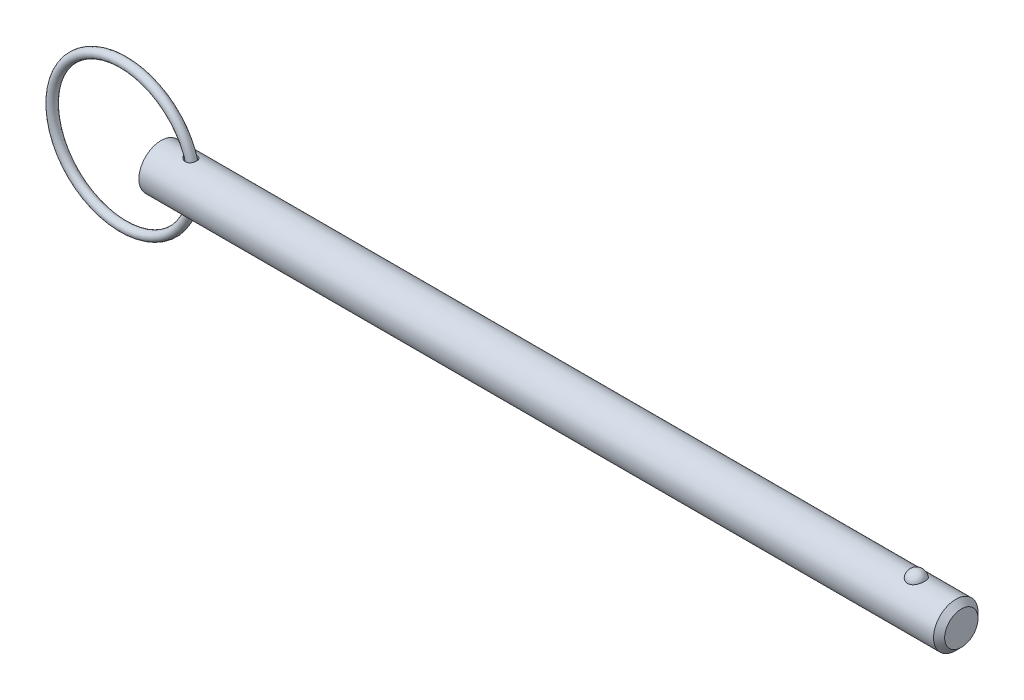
ISO-10303-21;
HEADER;
FILE_DESCRIPTION(('STEP AP214'),'2;1');
FILE_NAME('part.step','',(''),(''),'','','');
FILE_SCHEMA(('AUTOMOTIVE_DESIGN { 1 0 10303 214 1 1 1 1 }'));
ENDSEC;
DATA;
#1=APPLICATION_CONTEXT('core data for automotive mechanical design processes');
#2=APPLICATION_PROTOCOL_DEFINITION('international standard','automotive_design',2000,#1);
#3=PRODUCT_CONTEXT('',#1,'mechanical');
#4=PRODUCT('Part','Part','',(#3));
#5=PRODUCT_RELATED_PRODUCT_CATEGORY('part','',(#4));
#6=PRODUCT_DEFINITION_FORMATION('','',#4);
#7=PRODUCT_DEFINITION_CONTEXT('part definition',#1,'design');
#8=PRODUCT_DEFINITION('design','',#6,#7);
#9=PRODUCT_DEFINITION_SHAPE('','',#8);
#10=(LENGTH_UNIT() NAMED_UNIT(*) SI_UNIT(.MILLI.,.METRE.));
#11=(NAMED_UNIT(*) PLANE_ANGLE_UNIT() SI_UNIT($,.RADIAN.));
#12=(NAMED_UNIT(*) SI_UNIT($,.STERADIAN.) SOLID_ANGLE_UNIT());
#13=UNCERTAINTY_MEASURE_WITH_UNIT(LENGTH_MEASURE(1.E-05),#10,'distance_accuracy_value','');
#14=(GEOMETRIC_REPRESENTATION_CONTEXT(3) GLOBAL_UNCERTAINTY_ASSIGNED_CONTEXT((#13)) GLOBAL_UNIT_ASSIGNED_CONTEXT((#10,
#11,#12)) REPRESENTATION_CONTEXT('',''));
#15=CARTESIAN_POINT('',(0.,0.,0.));
#16=DIRECTION('',(0.,0.,1.));
#17=DIRECTION('',(1.,0.,0.));
#18=AXIS2_PLACEMENT_3D('',#15,#16,#17);
#19=CARTESIAN_POINT('',(-6.75433730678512,0.,0.));
#20=DIRECTION('',(0.,0.,1.));
#21=DIRECTION('',(1.,0.,0.));
#22=AXIS2_PLACEMENT_3D('',#19,#20,#21);
#23=TOROIDAL_SURFACE('',#22,12.7,0.794);
#24=CARTESIAN_POINT('',(6.73966269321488,0.,0.));
#25=VERTEX_POINT('',#24);
#26=VERTEX_LOOP('',#25);
#27=FACE_BOUND('',#26,.T.);
#28=ADVANCED_FACE('P0_F12',(#27),#23,.T.);
#29=CLOSED_SHELL('',(#28));
#30=MANIFOLD_SOLID_BREP('P0_B1',#29);
#31=CARTESIAN_POINT('',(0.,0.,0.));
#32=DIRECTION('',(1.,0.,0.));
#33=DIRECTION('',(0.,0.,-1.));
#34=AXIS2_PLACEMENT_3D('',#31,#32,#33);
#35=CYLINDRICAL_SURFACE('',#34,3.97);
#36=CARTESIAN_POINT('',(4.50613409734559,3.92152479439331,-0.618499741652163));
#37=CARTESIAN_POINT('',(4.54853517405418,3.91408351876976,-0.665679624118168));
#38=CARTESIAN_POINT('',(4.59520918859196,3.90637054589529,-0.709047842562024));
#39=CARTESIAN_POINT('',(4.69529850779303,3.89134328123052,-0.787367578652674));
#40=CARTESIAN_POINT('',(4.74872860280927,3.88402991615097,-0.822300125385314));
#41=CARTESIAN_POINT('',(4.86059505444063,3.87069188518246,-0.882953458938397));
#42=CARTESIAN_POINT('',(4.91902090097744,3.86466460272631,-0.908693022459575));
#43=CARTESIAN_POINT('',(5.03942053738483,3.85463812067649,-0.950329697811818));
#44=CARTESIAN_POINT('',(5.10139227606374,3.85063776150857,-0.966232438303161));
#45=CARTESIAN_POINT('',(5.22799334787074,3.84521819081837,-0.987584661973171));
#46=CARTESIAN_POINT('',(5.29264515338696,3.84382942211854,-0.992910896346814));
#47=CARTESIAN_POINT('',(5.4218778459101,3.84405510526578,-0.992040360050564));
#48=CARTESIAN_POINT('',(5.48645875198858,3.84566813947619,-0.985849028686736));
#49=CARTESIAN_POINT('',(5.60832575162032,3.85155853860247,-0.962561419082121));
#50=CARTESIAN_POINT('',(5.66579014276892,3.85562063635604,-0.946343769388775));
#51=CARTESIAN_POINT('',(5.77675338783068,3.86576598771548,-0.904004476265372));
#52=CARTESIAN_POINT('',(5.83025379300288,3.87184844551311,-0.877886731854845));
#53=CARTESIAN_POINT('',(5.92811265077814,3.88482601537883,-0.818464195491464));
#54=CARTESIAN_POINT('',(5.97284196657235,3.89164057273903,-0.785750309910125));
#55=CARTESIAN_POINT('',(6.05599619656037,3.90559314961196,-0.713164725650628));
#56=CARTESIAN_POINT('',(6.09442162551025,3.91273114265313,-0.673293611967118));
#57=CARTESIAN_POINT('',(6.16349552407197,3.92643411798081,-0.588089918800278));
#58=CARTESIAN_POINT('',(6.19423746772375,3.93300527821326,-0.542833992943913));
#59=CARTESIAN_POINT('',(6.24784048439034,3.94496273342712,-0.447731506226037));
#60=CARTESIAN_POINT('',(6.27070130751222,3.95034899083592,-0.3978847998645));
#61=CARTESIAN_POINT('',(6.30819009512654,3.95940331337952,-0.294515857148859));
#62=CARTESIAN_POINT('',(6.32274046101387,3.96305513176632,-0.240964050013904));
#63=CARTESIAN_POINT('',(6.34295490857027,3.96817541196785,-0.132107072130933));
#64=CARTESIAN_POINT('',(6.3486187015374,3.96964380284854,-0.0768018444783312));
#65=CARTESIAN_POINT('',(6.35094049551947,3.97024250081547,0.0343098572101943));
#66=CARTESIAN_POINT('',(6.34754972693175,3.96936014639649,0.0901174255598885));
#67=CARTESIAN_POINT('',(6.33173352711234,3.9653248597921,0.200354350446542));
#68=CARTESIAN_POINT('',(6.31930791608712,3.96217188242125,0.254783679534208));
#69=CARTESIAN_POINT('',(6.28569545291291,3.95393415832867,0.360736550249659));
#70=CARTESIAN_POINT('',(6.26450524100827,3.94884867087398,0.412258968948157));
#71=CARTESIAN_POINT('',(6.21385621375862,3.93730247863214,0.510898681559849));
#72=CARTESIAN_POINT('',(6.18439757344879,3.93084180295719,0.558016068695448));
#73=CARTESIAN_POINT('',(6.11807283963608,3.91729312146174,0.646300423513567));
#74=CARTESIAN_POINT('',(6.08123803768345,3.91020783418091,0.687491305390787));
#75=CARTESIAN_POINT('',(6.00105036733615,3.89618447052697,0.762970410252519));
#76=CARTESIAN_POINT('',(5.95769831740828,3.88924637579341,0.79725949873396));
#77=CARTESIAN_POINT('',(5.8661353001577,3.87636375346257,0.857702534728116));
#78=CARTESIAN_POINT('',(5.81797537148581,3.87041026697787,0.883931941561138));
#79=CARTESIAN_POINT('',(5.71784316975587,3.86006042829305,0.928089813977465));
#80=CARTESIAN_POINT('',(5.66587104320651,3.85566401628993,0.946018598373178));
#81=CARTESIAN_POINT('',(5.55935910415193,3.84884784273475,0.973381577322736));
#82=CARTESIAN_POINT('',(5.50480823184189,3.84643760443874,0.982774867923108));
#83=CARTESIAN_POINT('',(5.39486598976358,3.84381055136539,0.992999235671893));
#84=CARTESIAN_POINT('',(5.33947443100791,3.84359423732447,0.993828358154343));
#85=CARTESIAN_POINT('',(5.2264823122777,3.84533176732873,0.987084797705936));
#86=CARTESIAN_POINT('',(5.16890896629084,3.84739412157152,0.979092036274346));
#87=CARTESIAN_POINT('',(5.05572652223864,3.85355237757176,0.954563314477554));
#88=CARTESIAN_POINT('',(5.00011821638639,3.85764908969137,0.938023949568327));
#89=CARTESIAN_POINT('',(4.88760177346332,3.86780726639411,0.895259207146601));
#90=CARTESIAN_POINT('',(4.83096658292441,3.87400321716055,0.868345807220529));
#91=CARTESIAN_POINT('',(4.72283286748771,3.88749324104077,0.805802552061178));
#92=CARTESIAN_POINT('',(4.6713374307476,3.89478796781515,0.770167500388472));
#93=CARTESIAN_POINT('',(4.57320957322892,3.90992457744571,0.689306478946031));
#94=CARTESIAN_POINT('',(4.52683185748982,3.91777672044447,0.643771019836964));
#95=CARTESIAN_POINT('',(4.44324307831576,3.93275681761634,0.544809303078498));
#96=CARTESIAN_POINT('',(4.40602610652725,3.939885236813,0.491388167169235));
#97=CARTESIAN_POINT('',(4.34571986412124,3.95183347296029,0.382912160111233));
#98=CARTESIAN_POINT('',(4.32168268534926,3.95680025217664,0.328404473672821));
#99=CARTESIAN_POINT('',(4.28478280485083,3.96454157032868,0.215602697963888));
#100=CARTESIAN_POINT('',(4.27190231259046,3.96731959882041,0.157314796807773));
#101=CARTESIAN_POINT('',(4.25937356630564,3.97002560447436,0.0481762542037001));
#102=CARTESIAN_POINT('',(4.25802727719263,3.97031923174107,-0.00247526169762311));
#103=CARTESIAN_POINT('',(4.26422295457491,3.96897737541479,-0.103210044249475));
#104=CARTESIAN_POINT('',(4.27176468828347,3.96734194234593,-0.153293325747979));
#105=CARTESIAN_POINT('',(4.29457390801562,3.96248430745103,-0.248530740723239));
#106=CARTESIAN_POINT('',(4.30937736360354,3.95935769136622,-0.293803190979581));
#107=CARTESIAN_POINT('',(4.34569993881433,3.95187968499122,-0.381417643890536));
#108=CARTESIAN_POINT('',(4.36721517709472,3.94752900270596,-0.42376132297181));
#109=CARTESIAN_POINT('',(4.40821696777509,3.93952317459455,-0.491758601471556));
#110=CARTESIAN_POINT('',(4.42613511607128,3.93609353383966,-0.518404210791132));
#111=CARTESIAN_POINT('',(4.46438343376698,3.92897396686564,-0.569857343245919));
#112=CARTESIAN_POINT('',(4.48471350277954,3.92528405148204,-0.594664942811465));
#113=CARTESIAN_POINT('',(4.50613409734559,3.92152479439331,-0.618499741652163));
#114=B_SPLINE_CURVE_WITH_KNOTS('',3,(#36,#37,#38,#39,#40,#41,#42,#43,#44,#45,#46,#47,#48,#49,
#50,#51,#52,#53,#54,#55,#56,#57,#58,#59,#60,#61,#62,#63,#64,#65,#66,#67,#68,#69,#70,#71,#72,#73,
#74,#75,#76,#77,#78,#79,#80,#81,#82,#83,#84,#85,#86,#87,#88,#89,#90,#91,#92,#93,#94,#95,#96,#97,
#98,#99,#100,#101,#102,#103,#104,#105,#106,#107,#108,#109,#110,#111,#112,#113),.UNSPECIFIED.,
.T.,.F.,(4,2,2,2,2,2,2,2,2,2,2,2,2,2,2,2,2,2,2,2,2,2,2,2,2,2,2,2,2,2,2,2,2,2,2,2,2,2,4),(0.,
0.191481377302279,0.383389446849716,0.574903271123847,0.766307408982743,0.959929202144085,
1.15345957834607,1.33205157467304,1.51057330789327,1.67726576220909,1.84394459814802,
2.00848443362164,2.17302948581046,2.33908685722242,2.50514962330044,2.6721086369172,
2.83907097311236,3.00609737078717,3.17312023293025,3.33944900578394,3.5057569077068,
3.67045663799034,3.83515004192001,4.00062859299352,4.16614491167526,4.33989638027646,
4.51371711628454,4.70191549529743,4.8902262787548,5.08559712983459,5.28084164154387,
5.45908728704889,5.63704817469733,5.78825771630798,5.93946329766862,6.08206496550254,
6.22458432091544,6.32132279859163,6.41805725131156),.UNSPECIFIED.);
#115=CARTESIAN_POINT('',(4.50613409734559,3.92152479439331,-0.618499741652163));
#116=VERTEX_POINT('',#115);
#117=EDGE_CURVE('P1_E40',#116,#116,#114,.T.);
#118=ORIENTED_EDGE('',*,*,#117,.T.);
#119=EDGE_LOOP('',(#118));
#120=FACE_BOUND('',#119,.T.);
#121=CARTESIAN_POINT('',(141.8875,0.,0.));
#122=DIRECTION('',(1.,0.,0.));
#123=DIRECTION('',(0.,0.,-1.));
#124=AXIS2_PLACEMENT_3D('',#121,#122,#123);
#125=CIRCLE('',#124,3.97);
#126=CARTESIAN_POINT('',(141.8875,0.,-3.97));
#127=VERTEX_POINT('',#126);
#128=EDGE_CURVE('P1_E25',#127,#127,#125,.T.);
#129=ORIENTED_EDGE('',*,*,#128,.F.);
#130=EDGE_LOOP('',(#129));
#131=FACE_BOUND('',#130,.T.);
#132=CARTESIAN_POINT('',(0.,0.,0.));
#133=DIRECTION('',(1.,0.,0.));
#134=DIRECTION('',(0.,0.,-1.));
#135=AXIS2_PLACEMENT_3D('',#132,#133,#134);
#136=CIRCLE('',#135,3.97);
#137=CARTESIAN_POINT('',(0.,0.,-3.97));
#138=VERTEX_POINT('',#137);
#139=EDGE_CURVE('P1_E9',#138,#138,#136,.T.);
#140=ORIENTED_EDGE('',*,*,#139,.T.);
#141=EDGE_LOOP('',(#140));
#142=FACE_BOUND('',#141,.T.);
#143=CARTESIAN_POINT('',(134.845192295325,3.65715365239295,1.54470941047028));
#144=CARTESIAN_POINT('',(134.765244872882,3.65716001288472,1.54470290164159));
#145=CARTESIAN_POINT('',(134.685165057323,3.65987074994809,1.53832549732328));
#146=CARTESIAN_POINT('',(134.527237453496,3.67042218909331,1.51297018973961));
#147=CARTESIAN_POINT('',(134.44939614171,3.67827646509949,1.49395894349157));
#148=CARTESIAN_POINT('',(134.298461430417,3.69818848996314,1.44395950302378));
#149=CARTESIAN_POINT('',(134.225356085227,3.71023513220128,1.41300293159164));
#150=CARTESIAN_POINT('',(134.085563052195,3.73721833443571,1.34000212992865));
#151=CARTESIAN_POINT('',(134.018872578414,3.75215363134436,1.2979627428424));
#152=CARTESIAN_POINT('',(133.89148864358,3.78384968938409,1.20248834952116));
#153=CARTESIAN_POINT('',(133.831029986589,3.80065129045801,1.14875388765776));
#154=CARTESIAN_POINT('',(133.719694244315,3.83398532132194,1.03205417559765));
#155=CARTESIAN_POINT('',(133.668820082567,3.85051766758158,0.969086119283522));
#156=CARTESIAN_POINT('',(133.575632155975,3.88238608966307,0.832526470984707));
#157=CARTESIAN_POINT('',(133.533796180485,3.89763698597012,0.758588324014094));
#158=CARTESIAN_POINT('',(133.46251087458,3.92451063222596,0.604352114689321));
#159=CARTESIAN_POINT('',(133.433062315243,3.93613315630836,0.524053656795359));
#160=CARTESIAN_POINT('',(133.386892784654,3.95467606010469,0.358403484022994));
#161=CARTESIAN_POINT('',(133.370312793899,3.96154426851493,0.273006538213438));
#162=CARTESIAN_POINT('',(133.350756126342,3.96967008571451,0.100408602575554));
#163=CARTESIAN_POINT('',(133.347778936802,3.97092790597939,0.0132076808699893));
#164=CARTESIAN_POINT('',(133.355458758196,3.96771794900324,-0.15984454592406));
#165=CARTESIAN_POINT('',(133.366016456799,3.96329187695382,-0.24570105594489));
#166=CARTESIAN_POINT('',(133.40038009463,3.94923163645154,-0.414277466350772));
#167=CARTESIAN_POINT('',(133.424186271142,3.93959737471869,-0.496997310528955));
#168=CARTESIAN_POINT('',(133.48461142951,3.91607752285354,-0.657113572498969));
#169=CARTESIAN_POINT('',(133.521249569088,3.90218558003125,-0.734501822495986));
#170=CARTESIAN_POINT('',(133.606593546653,3.87158287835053,-0.881704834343));
#171=CARTESIAN_POINT('',(133.655300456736,3.85487186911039,-0.951518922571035));
#172=CARTESIAN_POINT('',(133.764116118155,3.82028735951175,-1.08208159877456));
#173=CARTESIAN_POINT('',(133.824295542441,3.80240713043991,-1.14276958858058));
#174=CARTESIAN_POINT('',(133.954493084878,3.76758161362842,-1.25282437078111));
#175=CARTESIAN_POINT('',(134.024510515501,3.75063626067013,-1.30219195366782));
#176=CARTESIAN_POINT('',(134.17118160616,3.71998948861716,-1.38729709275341));
#177=CARTESIAN_POINT('',(134.247681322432,3.70623183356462,-1.42327904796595));
#178=CARTESIAN_POINT('',(134.406298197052,3.68323188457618,-1.48178996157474));
#179=CARTESIAN_POINT('',(134.4884132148,3.67398788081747,-1.50432401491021));
#180=CARTESIAN_POINT('',(134.651481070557,3.6615216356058,-1.53440939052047));
#181=CARTESIAN_POINT('',(134.732284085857,3.65801951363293,-1.54265826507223));
#182=CARTESIAN_POINT('',(134.89420850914,3.65657341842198,-1.54608423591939));
#183=CARTESIAN_POINT('',(134.975329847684,3.65862829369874,-1.54126404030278));
#184=CARTESIAN_POINT('',(135.132812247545,3.66788969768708,-1.51908474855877));
#185=CARTESIAN_POINT('',(135.209242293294,3.67492621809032,-1.50213925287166));
#186=CARTESIAN_POINT('',(135.358041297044,3.6931840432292,-1.45666982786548));
#187=CARTESIAN_POINT('',(135.430409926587,3.70440568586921,-1.42814496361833));
#188=CARTESIAN_POINT('',(135.570802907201,3.73012749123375,-1.3595631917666));
#189=CARTESIAN_POINT('',(135.638700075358,3.74469307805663,-1.31927107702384));
#190=CARTESIAN_POINT('',(135.766864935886,3.77545272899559,-1.2284744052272));
#191=CARTESIAN_POINT('',(135.827130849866,3.79164717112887,-1.17796747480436));
#192=CARTESIAN_POINT('',(135.941634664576,3.82490325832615,-1.06519260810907));
#193=CARTESIAN_POINT('',(135.995413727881,3.84196735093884,-1.00245914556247));
#194=CARTESIAN_POINT('',(136.092098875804,3.8743986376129,-0.868715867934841));
#195=CARTESIAN_POINT('',(136.135003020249,3.88976552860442,-0.79770457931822));
#196=CARTESIAN_POINT('',(136.210266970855,3.91771381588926,-0.646896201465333));
#197=CARTESIAN_POINT('',(136.24225322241,3.93019255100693,-0.56689319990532));
#198=CARTESIAN_POINT('',(136.293110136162,3.95043886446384,-0.402255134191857));
#199=CARTESIAN_POINT('',(136.311980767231,3.95820643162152,-0.317620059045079));
#200=CARTESIAN_POINT('',(136.33621625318,3.96823733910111,-0.146156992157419));
#201=CARTESIAN_POINT('',(136.341587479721,3.970503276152,-0.059330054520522));
#202=CARTESIAN_POINT('',(136.338730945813,3.96930811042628,0.114057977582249));
#203=CARTESIAN_POINT('',(136.330503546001,3.9658471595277,0.200619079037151));
#204=CARTESIAN_POINT('',(136.300706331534,3.95358562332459,0.370506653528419));
#205=CARTESIAN_POINT('',(136.27921294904,3.94481563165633,0.453848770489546));
#206=CARTESIAN_POINT('',(136.22338397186,3.92284586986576,0.615497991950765));
#207=CARTESIAN_POINT('',(136.189047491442,3.90964579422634,0.693804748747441));
#208=CARTESIAN_POINT('',(136.107970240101,3.88006987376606,0.843703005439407));
#209=CARTESIAN_POINT('',(136.061153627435,3.86367478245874,0.915249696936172));
#210=CARTESIAN_POINT('',(135.956189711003,3.82949741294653,1.04910810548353));
#211=CARTESIAN_POINT('',(135.898042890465,3.81171519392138,1.11142021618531));
#212=CARTESIAN_POINT('',(135.771743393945,3.7767336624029,1.22503948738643));
#213=CARTESIAN_POINT('',(135.703597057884,3.75953398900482,1.27635357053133));
#214=CARTESIAN_POINT('',(135.558900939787,3.72770506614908,1.36653336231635));
#215=CARTESIAN_POINT('',(135.482348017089,3.7130767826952,1.4053943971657));
#216=CARTESIAN_POINT('',(135.325759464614,3.68864287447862,1.46830480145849));
#217=CARTESIAN_POINT('',(135.245930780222,3.67869017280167,1.49281289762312));
#218=CARTESIAN_POINT('',(135.082987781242,3.66414535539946,1.52817474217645));
#219=CARTESIAN_POINT('',(134.999884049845,3.65953723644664,1.53906926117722));
#220=CARTESIAN_POINT('',(134.892776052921,3.6573894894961,1.54414878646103));
#221=CARTESIAN_POINT('',(134.868990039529,3.65715175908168,1.54471134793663));
#222=CARTESIAN_POINT('',(134.845192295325,3.65715365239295,1.54470941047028));
#223=B_SPLINE_CURVE_WITH_KNOTS('',3,(#143,#144,#145,#146,#147,#148,#149,#150,#151,#152,#153,
#154,#155,#156,#157,#158,#159,#160,#161,#162,#163,#164,#165,#166,#167,#168,#169,#170,#171,#172,
#173,#174,#175,#176,#177,#178,#179,#180,#181,#182,#183,#184,#185,#186,#187,#188,#189,#190,#191,
#192,#193,#194,#195,#196,#197,#198,#199,#200,#201,#202,#203,#204,#205,#206,#207,#208,#209,#210,
#211,#212,#213,#214,#215,#216,#217,#218,#219,#220,#221,#222),.UNSPECIFIED.,.T.,.F.,(4,2,2,2,2,2,
2,2,2,2,2,2,2,2,2,2,2,2,2,2,2,2,2,2,2,2,2,2,2,2,2,2,2,2,2,2,2,2,2,4),(0.,0.239777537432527,
0.48019041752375,0.719971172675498,0.959647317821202,1.20639040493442,1.45320863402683,
1.71093679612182,1.96868099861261,2.22921052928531,2.48973023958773,2.74834928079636,
3.00697295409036,3.26598440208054,3.52501886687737,3.78570385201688,4.04637062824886,
4.30201257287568,4.55755760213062,4.80022994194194,5.04285200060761,5.27757006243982,
5.5123070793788,5.75210128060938,5.99195126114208,6.24392810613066,6.49594987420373,
6.75588818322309,7.01582710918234,7.27564332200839,7.53545264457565,7.79377886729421,
8.05212290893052,8.31207418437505,8.57201437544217,8.83179046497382,9.09166393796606,
9.3427005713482,9.59298357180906,9.66435753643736),.UNSPECIFIED.);
#224=CARTESIAN_POINT('',(134.845192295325,3.65715365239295,1.54470941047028));
#225=VERTEX_POINT('',#224);
#226=EDGE_CURVE('P1_E34',#225,#225,#223,.T.);
#227=ORIENTED_EDGE('',*,*,#226,.T.);
#228=EDGE_LOOP('',(#227));
#229=FACE_BOUND('',#228,.T.);
#230=CARTESIAN_POINT('',(4.50613409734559,-3.92152479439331,-0.618499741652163));
#231=CARTESIAN_POINT('',(4.47063221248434,-3.92775524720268,-0.57899519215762));
#232=CARTESIAN_POINT('',(4.43810149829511,-3.93379908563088,-0.536794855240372));
#233=CARTESIAN_POINT('',(4.38017497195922,-3.94493883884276,-0.447628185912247));
#234=CARTESIAN_POINT('',(4.3547746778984,-3.95003534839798,-0.400664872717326));
#235=CARTESIAN_POINT('',(4.3122178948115,-3.95875465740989,-0.302642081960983));
#236=CARTESIAN_POINT('',(4.29511088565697,-3.96236859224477,-0.251560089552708));
#237=CARTESIAN_POINT('',(4.27046538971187,-3.96762012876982,-0.14703606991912));
#238=CARTESIAN_POINT('',(4.26292104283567,-3.96925894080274,-0.0935955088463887));
#239=CARTESIAN_POINT('',(4.25814817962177,-3.97029345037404,0.00916757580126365));
#240=CARTESIAN_POINT('',(4.26009234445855,-3.96986905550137,0.058451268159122));
#241=CARTESIAN_POINT('',(4.27229463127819,-3.96723648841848,0.15592126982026));
#242=CARTESIAN_POINT('',(4.28255257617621,-3.96502835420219,0.204107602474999));
#243=CARTESIAN_POINT('',(4.31040382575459,-3.95915538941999,0.296804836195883));
#244=CARTESIAN_POINT('',(4.32779766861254,-3.95553028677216,0.341378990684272));
#245=CARTESIAN_POINT('',(4.36906896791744,-3.94717481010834,0.427290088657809));
#246=CARTESIAN_POINT('',(4.39294824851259,-3.94244412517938,0.468626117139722));
#247=CARTESIAN_POINT('',(4.44891306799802,-3.93178155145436,0.551268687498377));
#248=CARTESIAN_POINT('',(4.48157347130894,-3.92577737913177,0.592175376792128));
#249=CARTESIAN_POINT('',(4.5525111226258,-3.91346489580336,0.668729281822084));
#250=CARTESIAN_POINT('',(4.59079150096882,-3.90715641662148,0.704373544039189));
#251=CARTESIAN_POINT('',(4.67775521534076,-3.89387548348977,0.774654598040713));
#252=CARTESIAN_POINT('',(4.72714377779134,-3.88693620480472,0.808427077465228));
#253=CARTESIAN_POINT('',(4.83064277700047,-3.8740635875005,0.868022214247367));
#254=CARTESIAN_POINT('',(4.88475591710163,-3.86813083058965,0.893840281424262));
#255=CARTESIAN_POINT('',(5.00110106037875,-3.85749476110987,0.93872983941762));
#256=CARTESIAN_POINT('',(5.06363405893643,-3.85293457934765,0.957062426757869));
#257=CARTESIAN_POINT('',(5.19104406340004,-3.84642688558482,0.98289453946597));
#258=CARTESIAN_POINT('',(5.25592057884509,-3.84447883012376,0.990396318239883));
#259=CARTESIAN_POINT('',(5.38389367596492,-3.84360582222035,0.993779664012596));
#260=CARTESIAN_POINT('',(5.44697893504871,-3.84458391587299,0.990033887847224));
#261=CARTESIAN_POINT('',(5.57135239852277,-3.84935403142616,0.971322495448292));
#262=CARTESIAN_POINT('',(5.63264168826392,-3.85314431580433,0.956363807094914));
#263=CARTESIAN_POINT('',(5.74616757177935,-3.86267246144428,0.917075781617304));
#264=CARTESIAN_POINT('',(5.79873169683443,-3.86821908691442,0.893643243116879));
#265=CARTESIAN_POINT('',(5.89880370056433,-3.88065529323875,0.837987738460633));
#266=CARTESIAN_POINT('',(5.94631268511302,-3.88754457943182,0.805766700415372));
#267=CARTESIAN_POINT('',(6.03285109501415,-3.90151699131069,0.735052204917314));
#268=CARTESIAN_POINT('',(6.07216200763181,-3.90857818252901,0.696897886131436));
#269=CARTESIAN_POINT('',(6.14379115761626,-3.92238187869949,0.614461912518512));
#270=CARTESIAN_POINT('',(6.17610956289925,-3.92912439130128,0.570180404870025));
#271=CARTESIAN_POINT('',(6.23298117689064,-3.94155789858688,0.47670081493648));
#272=CARTESIAN_POINT('',(6.25752764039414,-3.94724797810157,0.427498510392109));
#273=CARTESIAN_POINT('',(6.29825018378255,-3.95695712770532,0.325589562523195));
#274=CARTESIAN_POINT('',(6.31442591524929,-3.96097612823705,0.272882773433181));
#275=CARTESIAN_POINT('',(6.33815165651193,-3.96694319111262,0.164947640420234));
#276=CARTESIAN_POINT('',(6.34562253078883,-3.96887224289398,0.109700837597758));
#277=CARTESIAN_POINT('',(6.35150690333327,-3.97038782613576,-0.00130546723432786));
#278=CARTESIAN_POINT('',(6.34992017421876,-3.96997429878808,-0.0570649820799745));
#279=CARTESIAN_POINT('',(6.33770614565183,-3.96684417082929,-0.167685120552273));
#280=CARTESIAN_POINT('',(6.32705245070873,-3.96412084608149,-0.222542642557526));
#281=CARTESIAN_POINT('',(6.29690849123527,-3.95665587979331,-0.329631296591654));
#282=CARTESIAN_POINT('',(6.27741810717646,-3.95191421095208,-0.381862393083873));
#283=CARTESIAN_POINT('',(6.2300755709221,-3.94093577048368,-0.482151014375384));
#284=CARTESIAN_POINT('',(6.20223216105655,-3.93470056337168,-0.530212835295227));
#285=CARTESIAN_POINT('',(6.13885089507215,-3.92142345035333,-0.620836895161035));
#286=CARTESIAN_POINT('',(6.10331353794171,-3.9143815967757,-0.663399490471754));
#287=CARTESIAN_POINT('',(6.02573506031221,-3.90033441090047,-0.741525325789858));
#288=CARTESIAN_POINT('',(5.98374081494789,-3.89332916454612,-0.777135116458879));
#289=CARTESIAN_POINT('',(5.89422937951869,-3.88009391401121,-0.840731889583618));
#290=CARTESIAN_POINT('',(5.84671289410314,-3.87386381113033,-0.868719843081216));
#291=CARTESIAN_POINT('',(5.74792005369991,-3.86290904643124,-0.916201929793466));
#292=CARTESIAN_POINT('',(5.69667597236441,-3.85817300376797,-0.935760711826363));
#293=CARTESIAN_POINT('',(5.59158164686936,-3.85061943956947,-0.966374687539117));
#294=CARTESIAN_POINT('',(5.53773121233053,-3.84780205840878,-0.97742925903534));
#295=CARTESIAN_POINT('',(5.42780663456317,-3.844282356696,-0.991183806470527));
#296=CARTESIAN_POINT('',(5.37170954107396,-3.84362414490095,-0.993709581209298));
#297=CARTESIAN_POINT('',(5.25980914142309,-3.84452352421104,-0.990222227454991));
#298=CARTESIAN_POINT('',(5.20400591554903,-3.84608169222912,-0.984206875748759));
#299=CARTESIAN_POINT('',(5.09021941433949,-3.85134557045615,-0.963410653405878));
#300=CARTESIAN_POINT('',(5.0323470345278,-3.85519050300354,-0.948059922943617));
#301=CARTESIAN_POINT('',(4.9197292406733,-3.86464451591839,-0.908751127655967));
#302=CARTESIAN_POINT('',(4.86498619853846,-3.87025491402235,-0.884786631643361));
#303=CARTESIAN_POINT('',(4.75497621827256,-3.88320265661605,-0.826208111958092));
#304=CARTESIAN_POINT('',(4.70013922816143,-3.89065244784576,-0.790807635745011));
#305=CARTESIAN_POINT('',(4.59743373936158,-3.90600301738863,-0.711112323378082));
#306=CARTESIAN_POINT('',(4.54956105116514,-3.91390352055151,-0.66682287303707));
#307=CARTESIAN_POINT('',(4.50613409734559,-3.92152479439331,-0.618499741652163));
#308=B_SPLINE_CURVE_WITH_KNOTS('',3,(#230,#231,#232,#233,#234,#235,#236,#237,#238,#239,#240,
#241,#242,#243,#244,#245,#246,#247,#248,#249,#250,#251,#252,#253,#254,#255,#256,#257,#258,#259,
#260,#261,#262,#263,#264,#265,#266,#267,#268,#269,#270,#271,#272,#273,#274,#275,#276,#277,#278,
#279,#280,#281,#282,#283,#284,#285,#286,#287,#288,#289,#290,#291,#292,#293,#294,#295,#296,#297,
#298,#299,#300,#301,#302,#303,#304,#305,#306,#307),.UNSPECIFIED.,.T.,.F.,(4,2,2,2,2,2,2,2,2,2,2,
2,2,2,2,2,2,2,2,2,2,2,2,2,2,2,2,2,2,2,2,2,2,2,2,2,2,2,4),(0.,0.160252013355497,
0.320403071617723,0.481498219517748,0.642494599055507,0.789717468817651,0.936937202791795,
1.08029540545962,1.22369397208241,1.38114509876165,1.53868426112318,1.7186296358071,
1.89867865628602,2.09368931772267,2.28865940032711,2.47724174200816,2.66570766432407,
2.83827720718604,3.01080892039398,3.17573461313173,3.34065634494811,3.50572082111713,
3.67079216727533,3.83735274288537,4.00391749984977,4.17096882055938,4.33802240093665,
4.50490174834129,4.6717702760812,4.83748008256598,5.0031687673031,5.16756302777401,
5.3319693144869,5.49971393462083,5.66750222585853,5.84673431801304,6.02610050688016,
6.22224398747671,6.41826898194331),.UNSPECIFIED.);
#309=CARTESIAN_POINT('',(4.50613409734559,-3.92152479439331,-0.618499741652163));
#310=VERTEX_POINT('',#309);
#311=EDGE_CURVE('P1_E17',#310,#310,#308,.T.);
#312=ORIENTED_EDGE('',*,*,#311,.T.);
#313=EDGE_LOOP('',(#312));
#314=FACE_BOUND('',#313,.T.);
#315=ADVANCED_FACE('P1_F13',(#120,#131,#142,#229,#314),#35,.T.);
#316=CARTESIAN_POINT('',(0.,0.,0.));
#317=DIRECTION('',(-1.,0.,0.));
#318=DIRECTION('',(0.,0.,1.));
#319=AXIS2_PLACEMENT_3D('',#316,#317,#318);
#320=PLANE('',#319);
#321=ORIENTED_EDGE('',*,*,#139,.F.);
#322=EDGE_LOOP('',(#321));
#323=FACE_BOUND('',#322,.T.);
#324=ADVANCED_FACE('P1_F15',(#323),#320,.T.);
#325=CARTESIAN_POINT('',(142.88,0.,0.));
#326=DIRECTION('',(-1.,0.,0.));
#327=DIRECTION('',(0.,0.,1.));
#328=AXIS2_PLACEMENT_3D('',#325,#326,#327);
#329=CONICAL_SURFACE('',#328,2.97750000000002,0.78539816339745);
#330=ORIENTED_EDGE('',*,*,#128,.T.);
#331=EDGE_LOOP('',(#330));
#332=FACE_BOUND('',#331,.T.);
#333=CARTESIAN_POINT('',(142.88,0.,0.));
#334=DIRECTION('',(1.,0.,0.));
#335=DIRECTION('',(0.,0.,-1.));
#336=AXIS2_PLACEMENT_3D('',#333,#334,#335);
#337=CIRCLE('',#336,2.97750000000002);
#338=CARTESIAN_POINT('',(142.88,0.,-2.97750000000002));
#339=VERTEX_POINT('',#338);
#340=EDGE_CURVE('P1_E30',#339,#339,#337,.T.);
#341=ORIENTED_EDGE('',*,*,#340,.F.);
#342=EDGE_LOOP('',(#341));
#343=FACE_BOUND('',#342,.T.);
#344=ADVANCED_FACE('P1_F55',(#332,#343),#329,.T.);
#345=CARTESIAN_POINT('',(142.88,2.97750000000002,0.));
#346=DIRECTION('',(1.,0.,0.));
#347=DIRECTION('',(0.,0.,-1.));
#348=AXIS2_PLACEMENT_3D('',#345,#346,#347);
#349=PLANE('',#348);
#350=ORIENTED_EDGE('',*,*,#340,.T.);
#351=EDGE_LOOP('',(#350));
#352=FACE_BOUND('',#351,.T.);
#353=ADVANCED_FACE('P1_F51',(#352),#349,.T.);
#354=CARTESIAN_POINT('',(134.845192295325,3.573,0.));
#355=DIRECTION('',(-1.,0.,0.));
#356=DIRECTION('',(0.,1.,0.));
#357=AXIS2_PLACEMENT_3D('',#354,#355,#356);
#358=SPHERICAL_SURFACE('',#357,1.54699999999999);
#359=ORIENTED_EDGE('',*,*,#226,.F.);
#360=EDGE_LOOP('',(#359));
#361=FACE_BOUND('',#360,.T.);
#362=ADVANCED_FACE('P1_F46',(#361),#358,.T.);
#363=CARTESIAN_POINT('',(-6.75433730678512,0.,0.));
#364=DIRECTION('',(0.,0.,1.));
#365=DIRECTION('',(1.,0.,0.));
#366=AXIS2_PLACEMENT_3D('',#363,#364,#365);
#367=TOROIDAL_SURFACE('',#366,12.7,0.9925);
#368=ORIENTED_EDGE('',*,*,#311,.F.);
#369=EDGE_LOOP('',(#368));
#370=FACE_BOUND('',#369,.T.);
#371=ORIENTED_EDGE('',*,*,#117,.F.);
#372=EDGE_LOOP('',(#371));
#373=FACE_BOUND('',#372,.T.);
#374=ADVANCED_FACE('P1_F50',(#370,#373),#367,.F.);
#375=CLOSED_SHELL('',(#315,#324,#344,#353,#362,#374));
#376=MANIFOLD_SOLID_BREP('P1_B1',#375);
#377=ADVANCED_BREP_SHAPE_REPRESENTATION('',(#18,#30,#376),#14);
#378=SHAPE_DEFINITION_REPRESENTATION(#9,#377);
ENDSEC;
END-ISO-10303-21;
